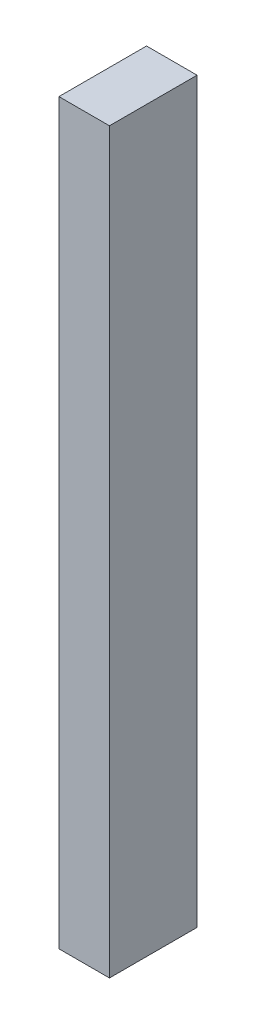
from build123d import *

# Parameters (mm, degrees)
SKETCH_1_W      = 3
SKETCH_1_H      = 43.8
EXTRUDE_1_DEPTH = 5.2


with BuildPart() as part:
    # Sketch 1 → Extrude 1 (new body)
    with BuildSketch(Plane.XY):
        Rectangle(SKETCH_1_W, SKETCH_1_H)
    extrude(amount=EXTRUDE_1_DEPTH)


solid = part.part
